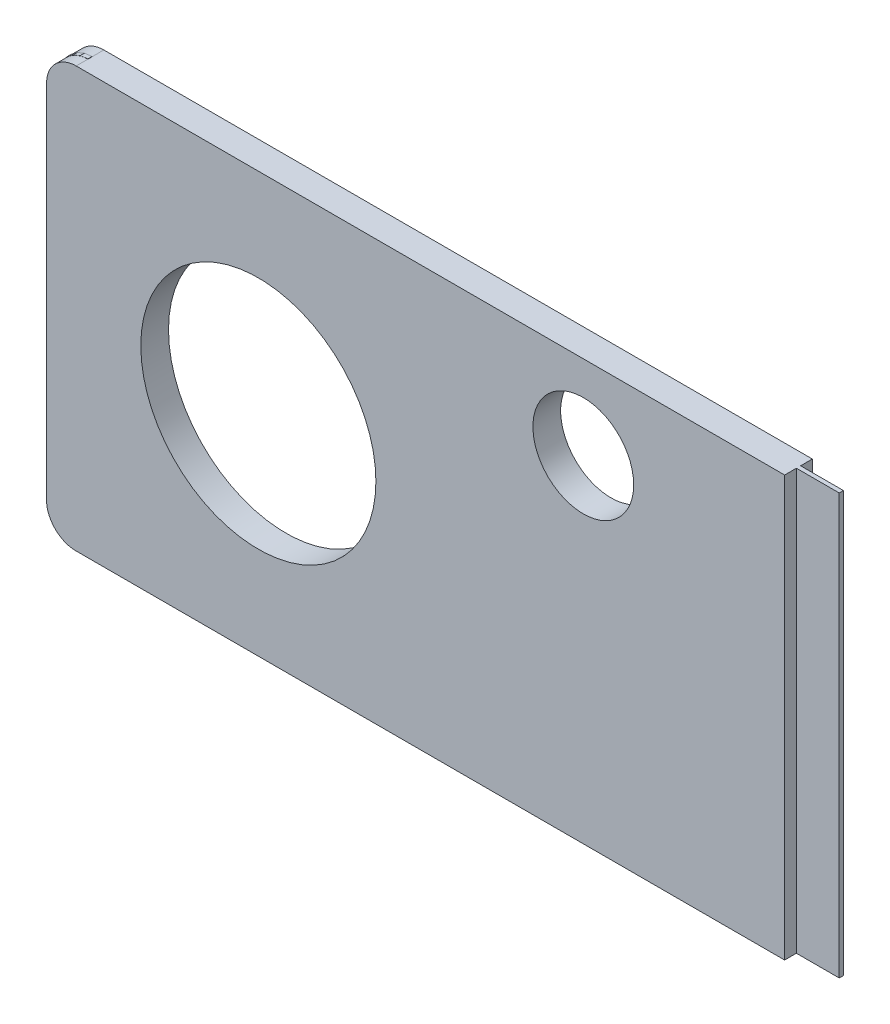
from build123d import *
from build123d.topology import SkipClean

# Parameters (mm, degrees)
SKETCH1_R                = 0.3175
SKETCH1_R_2              = 0.508
SKETCH1_R_3              = 1.524
SKETCH1_R_4              = 3.556
BOSS_EXTRUDE1_DEPTH      = 0.127
BOSS_EXTRUDE2_START      = 0.0508
SKETCH2_R                = 0.6985
SKETCH2_R_2              = 0.3175
BOSS_EXTRUDE2_DEPTH      = 0.0508
BOSS_EXTRUDE4_START      = 0.0508
SKETCH4_R                = 1.27
SKETCH4_R_2              = 0.508
BOSS_EXTRUDE4_DEPTH      = 0.0508
SKETCH5_R                = 1.27
SKETCH5_R_2              = 0.508
BOSS_EXTRUDE5_DEPTH      = 0.0508
BOSS_EXTRUDE6_DEPTH      = 0.3556
BOSS_EXTRUDE6_DEPTH_BACK = 0.4826
SKETCH6_R                = 3.556
SKETCH6_R_2              = 1.524
SKETCH7_W                = 5.08
SKETCH7_H                = 5.08
BOSS_EXTRUDE7_DEPTH      = 0.0508
BOSS_EXTRUDE8_START      = 0.3556
SKETCH9_R                = 1.524
BOSS_EXTRUDE8_DEPTH      = 0.3556
BOSS_EXTRUDE9_START      = 0.3556
SKETCH10_R               = 1.524
BOSS_EXTRUDE9_DEPTH      = 0.3556
BOSS_EXTRUDE10_START     = 0.3556
SKETCH11_R               = 5.2197
SKETCH11_R_2             = 3.556
SKETCH11_R_3             = 1.524
BOSS_EXTRUDE10_DEPTH     = 0.3556
SKETCH12_W               = 21.2598
SKETCH12_H               = 12.707452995
SKETCH12_R               = 1.524
BOSS_EXTRUDE11_DEPTH     = 0.3556
SKETCH13_W               = 21.2852
SKETCH13_H               = 12.707452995
SKETCH13_R               = 1.524
BOSS_EXTRUDE12_DEPTH     = 0.3556
SKETCH14_R               = 1.778
SKETCH14_R_2             = 1.524
SKETCH14_R_3             = 3.556
SKETCH14_R_4             = 5.2197
BOSS_EXTRUDE13_DEPTH     = 0.3556
BOSS_EXTRUDE17_DEPTH     = 0.0508
SKETCH18_W               = 1.099038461
SKETCH18_H               = 0.529166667
BOSS_EXTRUDE19_DEPTH     = 0.0508
SKETCH19_OUTSIDE_W       = 148.554
SKETCH19_OUTSIDE_H       = 44.448
SKETCH19_OUTSIDE_W_2     = 23.622
SKETCH19_OUTSIDE_H_2     = 19.197836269
CUT_EXTRUDE1_DEPTH       = 2.54


with BuildPart() as part:
    # Sketch1 → Boss-Extrude1 (new body)
    with BuildSketch(Plane.XY.offset(0.39116)):
        Polygon((156.11155468, 251.50762754), (156.337, 251.47794764), (256.286000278, 251.47794764), (256.286000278, 251.48474214), (256.491552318, 251.45768098), (256.683098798, 251.378339), (256.847581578, 251.25212894), (256.973791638, 251.08764616), (257.053133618, 250.89609968), (257.080194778, 250.69054764), (257.073399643, 247.66794764), (257.062440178, 247.66794764), (257.106087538, 247.3364116), (257.234055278, 247.02746886), (257.437623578, 246.76217348), (257.702918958, 246.55860518), (258.011861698, 246.43063744), (258.343398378, 246.386990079), (268.503400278, 246.397947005), (268.503400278, 246.38698754), (268.834936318, 246.4306349), (269.143879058, 246.55860264), (269.409174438, 246.76217094), (269.612742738, 247.02746632), (269.740710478, 247.33640906), (269.784357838, 247.6679451), (269.773400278, 250.63974764), (269.766166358, 250.63974764), (269.794975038, 250.85856102), (269.879432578, 251.0624646), (270.013788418, 251.2375595), (270.188883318, 251.37191534), (270.392786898, 251.45637288), (270.611600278, 251.48518156), (271.018000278, 251.47794764), (271.018000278, 251.46794258), (271.730094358, 251.50793234), (272.433234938, 251.62740124), (273.118577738, 251.8248456), (273.777501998, 252.0977813), (274.401727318, 252.4427768), (274.983397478, 252.85549632), (275.515202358, 253.33074556), (275.990451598, 253.86255044), (276.403171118, 254.4442206), (276.748166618, 255.06844592), (277.021102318, 255.72737018), (277.218546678, 256.41271298), (277.338015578, 257.11585356), (277.378005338, 257.82794764), (277.337522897, 258.536938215), (277.21811535, 259.240089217), (277.020730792, 259.925449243), (276.747852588, 260.584397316), (276.402911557, 261.208652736), (275.990242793, 261.790358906), (275.515039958, 262.322205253), (274.983276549, 262.797500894), (274.401642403, 263.210271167), (273.777447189, 263.555321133), (273.118546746, 263.828314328), (272.433221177, 264.025818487), (271.730091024, 264.14534874), (271.018000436, 264.185400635), (156.3624, 264.185400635), (156.3624, 264.19307334), (156.13032528, 264.16251968), (155.9140646, 264.0729415), (155.72835758, 263.93044496), (155.58586104, 263.74473794), (155.49628286, 263.52847726), (155.4657292, 263.296401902), (155.4734, 252.349), (155.46594764, 252.349), (155.49562754, 252.12355468), (155.5826454, 251.91347382), (155.72107286, 251.73307286), (155.90147382, 251.5946454), align=None)
        with Locations(Location((269.24, 259.7658, 0), (0, 0, 180))):
            Circle(SKETCH1_R, mode=Mode.SUBTRACT)
        with Locations(Location((270.9164, 258.8006, 0), (0, 0, 180))):
            Circle(SKETCH1_R, mode=Mode.SUBTRACT)
        with Locations(Location((267.5636, 258.8006, 0), (0, 0, 180))):
            Circle(SKETCH1_R, mode=Mode.SUBTRACT)
        with Locations(Location((269.24, 257.8354, 0), (0, 0, 180))):
            Circle(SKETCH1_R, mode=Mode.SUBTRACT)
        with Locations(Location((270.9164, 256.8702, 0), (0, 0, 180))):
            Circle(SKETCH1_R, mode=Mode.SUBTRACT)
        with Locations(Location((269.24, 255.905, 0), (0, 0, 180))):
            Circle(SKETCH1_R, mode=Mode.SUBTRACT)
        with Locations(Location((267.5636, 256.8702, 0), (0, 0, 180))):
            Circle(SKETCH1_R, mode=Mode.SUBTRACT)
        with Locations(Location((265.9634, 248.9454, 0), (0, 0, 180))):
            Circle(SKETCH1_R_2, mode=Mode.SUBTRACT)
        with Locations(Location((215.6714, 261.6454, 0), (0, 0, 180))):
            Circle(SKETCH1_R_3, mode=Mode.SUBTRACT)
        with Locations(Location((235.077, 261.6454, 0), (0, 0, 180))):
            Circle(SKETCH1_R_3, mode=Mode.SUBTRACT)
        with Locations(Location((171.704, 261.6454, 0), (0, 0, 180))):
            Circle(SKETCH1_R_3, mode=Mode.SUBTRACT)
        with Locations(Location((191.0842, 261.6454, 0), (0, 0, 180))):
            Circle(SKETCH1_R_3, mode=Mode.SUBTRACT)
        with Locations(Location((244.9068, 257.8354, 0), (0, 0, 180))):
            Circle(SKETCH1_R_4, mode=Mode.SUBTRACT)
        with Locations(Location((260.8834, 248.9454, 0), (0, 0, 180))):
            Circle(SKETCH1_R_2, mode=Mode.SUBTRACT)
        with Locations(Location((161.8742, 257.8354, 0), (0, 0, 180))):
            Circle(SKETCH1_R_4, mode=Mode.SUBTRACT)
    extrude(amount=-BOSS_EXTRUDE1_DEPTH)

    # Sketch2 → Boss-Extrude2 (add)
    # profile 1 of 7: a face of its own
    with BuildSketch(Plane.XY.offset(0.39116).offset(BOSS_EXTRUDE2_START)):
        with Locations((269.24, 259.7658)):
            Circle(SKETCH2_R)
        with Locations((269.24, 259.7658)):
            Circle(SKETCH2_R_2, mode=Mode.SUBTRACT)
    # profile 2 of 7: a face of its own
    with BuildSketch(Plane.XY.offset(0.39116).offset(BOSS_EXTRUDE2_START)):
        with Locations((270.9164, 258.8006)):
            Circle(SKETCH2_R)
        with Locations((270.9164, 258.8006)):
            Circle(SKETCH2_R_2, mode=Mode.SUBTRACT)
    # profile 3 of 7: a face of its own
    with BuildSketch(Plane.XY.offset(0.39116).offset(BOSS_EXTRUDE2_START)):
        with Locations((270.9164, 256.8702)):
            Circle(SKETCH2_R)
        with Locations((270.9164, 256.8702)):
            Circle(SKETCH2_R_2, mode=Mode.SUBTRACT)
    # profile 4 of 7: a face of its own
    with BuildSketch(Plane.XY.offset(0.39116).offset(BOSS_EXTRUDE2_START)):
        with Locations((269.24, 255.905)):
            Circle(SKETCH2_R)
        with Locations((269.24, 255.905)):
            Circle(SKETCH2_R_2, mode=Mode.SUBTRACT)
    # profile 5 of 7: a face of its own
    with BuildSketch(Plane.XY.offset(0.39116).offset(BOSS_EXTRUDE2_START)):
        with Locations((269.24, 257.8354)):
            Circle(SKETCH2_R)
        with Locations((269.24, 257.8354)):
            Circle(SKETCH2_R_2, mode=Mode.SUBTRACT)
    # profile 6 of 7: a face of its own
    with BuildSketch(Plane.XY.offset(0.39116).offset(BOSS_EXTRUDE2_START)):
        with Locations((267.5636, 256.8702)):
            Circle(SKETCH2_R)
        with Locations((267.5636, 256.8702)):
            Circle(SKETCH2_R_2, mode=Mode.SUBTRACT)
    # profile 7 of 7: a face of its own
    with BuildSketch(Plane.XY.offset(0.39116).offset(BOSS_EXTRUDE2_START)):
        with Locations((267.5636, 258.8006)):
            Circle(SKETCH2_R)
        with Locations((267.5636, 258.8006)):
            Circle(SKETCH2_R_2, mode=Mode.SUBTRACT)
    extrude(amount=-BOSS_EXTRUDE2_DEPTH)

    # Sketch4 → Boss-Extrude4 (add)
    # profile 1 of 2: a face of its own
    with BuildSketch(Plane.XY.offset(0.39116).offset(BOSS_EXTRUDE4_START)):
        with Locations((260.8834, 248.9454)):
            Circle(SKETCH4_R)
        with Locations((260.8834, 248.9454)):
            Circle(SKETCH4_R_2, mode=Mode.SUBTRACT)
    # profile 2 of 2: a face of its own
    with BuildSketch(Plane.XY.offset(0.39116).offset(BOSS_EXTRUDE4_START)):
        with Locations((265.9634, 248.9454)):
            Circle(SKETCH4_R)
        with Locations((265.9634, 248.9454)):
            Circle(SKETCH4_R_2, mode=Mode.SUBTRACT)
    extrude(amount=-BOSS_EXTRUDE4_DEPTH)

    # Sketch5 → Boss-Extrude5 (add)
    # profile 1 of 2: a face of its own
    with BuildSketch(Plane.XY.offset(0.26416)):
        with Locations((265.9634, 248.9454)):
            Circle(SKETCH5_R)
        with Locations((265.9634, 248.9454)):
            Circle(SKETCH5_R_2, mode=Mode.SUBTRACT)
    # profile 2 of 2: a face of its own
    with BuildSketch(Plane.XY.offset(0.26416)):
        with Locations((260.8834, 248.9454)):
            Circle(SKETCH5_R)
        with Locations((260.8834, 248.9454)):
            Circle(SKETCH5_R_2, mode=Mode.SUBTRACT)
    extrude(amount=-BOSS_EXTRUDE5_DEPTH)

    # Sketch6 → Boss-Extrude6 (add, two sides: drawn at the far end of the back side and taken through both)
    with SkipClean():  # the faces are left unmerged after this step: merging them gives an invalid solid
        with BuildSketch(Plane.XY.offset(0.39116).offset(-BOSS_EXTRUDE6_DEPTH_BACK)):
            with BuildLine():
                Line((177.79487504, 251.47794764), (177.79487504, 264.185402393))
                Line((177.79487504, 264.185402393), (156.3624, 264.185400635))
                ThreePointArc((156.3624, 264.185400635), (155.739568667, 263.929838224), (155.46827504, 263.313696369))
                Line((155.46827504, 263.313696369), (155.46827504, 252.300953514))
                ThreePointArc((155.46827504, 252.300953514), (155.743741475, 251.721727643), (156.337, 251.47794764))
                Line((156.337, 251.47794764), (177.79487504, 251.47794764))
            make_face()
            with Locations((161.8742, 257.8354)):
                Circle(SKETCH6_R, mode=Mode.SUBTRACT)
            with Locations((171.704, 261.6454)):
                Circle(SKETCH6_R_2, mode=Mode.SUBTRACT)
        extrude(amount=BOSS_EXTRUDE6_DEPTH + BOSS_EXTRUDE6_DEPTH_BACK)

    # Sketch7 → Boss-Extrude7 (add)
    with SkipClean():  # the faces are left unmerged after this step: merging them gives an invalid solid
        with BuildSketch(Plane.XY.offset(0.39116)):
            with Locations((185.3692, 254.65294764)):
                Rectangle(SKETCH7_W, SKETCH7_H)
            with BuildLine():
                Line((194.2592, 256.93894764), (194.2592, 252.36694764))
                ThreePointArc((194.2592, 252.36694764), (194.333594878, 252.187342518), (194.5132, 252.11294764))
                Line((194.5132, 252.11294764), (199.0852, 252.11294764))
                ThreePointArc((199.0852, 252.11294764), (199.264805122, 252.187342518), (199.3392, 252.36694764))
                Line((199.3392, 252.36694764), (199.3392, 256.93894764))
                ThreePointArc((199.3392, 256.93894764), (199.264805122, 257.118552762), (199.0852, 257.19294764))
                Line((199.0852, 257.19294764), (194.5132, 257.19294764))
                ThreePointArc((194.5132, 257.19294764), (194.333594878, 257.118552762), (194.2592, 256.93894764))
            make_face()
            with Locations((209.9564, 254.65294764)):
                Rectangle(SKETCH7_W, SKETCH7_H)
            with BuildLine():
                Line((219.1004, 257.19294764), (223.6724, 257.19294764))
                ThreePointArc((223.6724, 257.19294764), (223.852005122, 257.118552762), (223.9264, 256.93894764))
                Line((223.9264, 256.93894764), (223.9264, 252.36694764))
                ThreePointArc((223.9264, 252.36694764), (223.852005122, 252.187342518), (223.6724, 252.11294764))
                Line((223.6724, 252.11294764), (219.1004, 252.11294764))
                ThreePointArc((219.1004, 252.11294764), (218.920794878, 252.187342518), (218.8464, 252.36694764))
                Line((218.8464, 252.36694764), (218.8464, 256.93894764))
                ThreePointArc((218.8464, 256.93894764), (218.920794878, 257.118552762), (219.1004, 257.19294764))
            make_face()
        extrude(amount=BOSS_EXTRUDE7_DEPTH)

    # Sketch9 → Boss-Extrude8 (add)
    with SkipClean():  # the faces are left unmerged after this step: merging them gives an invalid solid
        with BuildSketch(Plane.XY.offset(0.39116).offset(BOSS_EXTRUDE8_START)):
            with BuildLine():
                ThreePointArc((188.602516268, 257.353947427), (188.453726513, 257.713157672), (188.094516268, 257.861947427))
                Line((188.094516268, 257.861947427), (180.79207504, 257.861947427))
                Line((180.79207504, 257.861947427), (180.79207504, 264.18540068))
                Line((180.79207504, 264.18540068), (202.05187504, 264.185401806))
                Line((202.05187504, 264.185401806), (202.05187504, 257.861947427))
                Line((202.05187504, 257.861947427), (194.107504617, 257.861947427))
                ThreePointArc((194.107504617, 257.861947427), (193.748294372, 257.713157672), (193.599504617, 257.353947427))
                Line((193.599504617, 257.353947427), (193.599504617, 255.16094764))
                ThreePointArc((193.599504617, 255.16094764), (193.450714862, 254.801737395), (193.091504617, 254.65294764))
                Line((193.091504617, 254.65294764), (189.110516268, 254.65294764))
                ThreePointArc((189.110516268, 254.65294764), (188.751306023, 254.801737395), (188.602516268, 255.16094764))
                Line((188.602516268, 255.16094764), (188.602516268, 257.353947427))
            make_face()
            with Locations((191.0842, 261.6454)):
                Circle(SKETCH9_R, mode=Mode.SUBTRACT)
        extrude(amount=-BOSS_EXTRUDE8_DEPTH)

    # Sketch10 → Boss-Extrude9 (add)
    with SkipClean():  # the faces are left unmerged after this step: merging them gives an invalid solid
        with BuildSketch(Plane.XY.offset(0.39116).offset(BOSS_EXTRUDE9_START)):
            with BuildLine():
                ThreePointArc((213.098791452, 257.353947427), (212.950001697, 257.713157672), (212.590791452, 257.861947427))
                Line((212.590791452, 257.861947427), (204.99827504, 257.861947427))
                Line((204.99827504, 257.861947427), (204.99827504, 264.185400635))
                Line((204.99827504, 264.185400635), (226.28347504, 264.185400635))
                Line((226.28347504, 264.185400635), (226.28347504, 257.861947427))
                Line((226.28347504, 257.861947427), (218.650909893, 257.861947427))
                ThreePointArc((218.650909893, 257.861947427), (218.291699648, 257.713157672), (218.142909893, 257.353947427))
                Line((218.142909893, 257.353947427), (218.142909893, 255.16094764))
                ThreePointArc((218.142909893, 255.16094764), (217.994120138, 254.801737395), (217.634909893, 254.65294764))
                Line((217.634909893, 254.65294764), (213.606791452, 254.65294764))
                ThreePointArc((213.606791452, 254.65294764), (213.247581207, 254.801737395), (213.098791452, 255.16094764))
                Line((213.098791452, 255.16094764), (213.098791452, 257.353947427))
            make_face()
            with Locations((215.6714, 261.6454)):
                Circle(SKETCH10_R, mode=Mode.SUBTRACT)
        extrude(amount=-BOSS_EXTRUDE9_DEPTH)

    # Sketch11 → Boss-Extrude10 (add)
    with SkipClean():  # the faces are left unmerged after this step: merging them gives an invalid solid
        with BuildSketch(Plane.XY.offset(0.39116).offset(BOSS_EXTRUDE10_START)):
            with BuildLine():
                ThreePointArc((271.730091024, 264.14534874), (277.367721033, 257.826642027), (271.730094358, 251.50793234))
                Line((271.730094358, 251.50793234), (229.22987504, 251.478351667))
                Line((229.22987504, 251.478351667), (229.22987504, 264.184362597))
                Line((229.22987504, 264.184362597), (271.730091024, 264.14534874))
            make_face()
            with Locations((269.24, 257.8354)):
                Circle(SKETCH11_R, mode=Mode.SUBTRACT)
            with Locations((244.9068, 257.8354)):
                Circle(SKETCH11_R_2, mode=Mode.SUBTRACT)
            with Locations((235.077, 261.6454)):
                Circle(SKETCH11_R_3, mode=Mode.SUBTRACT)
        extrude(amount=-BOSS_EXTRUDE10_DEPTH)

    # Sketch12 → Boss-Extrude11 (add)
    with SkipClean():  # the faces are left unmerged after this step: merging them gives an invalid solid
        with BuildSketch(Plane(origin=(0, 0, 0.26416), x_dir=(-1, 0, 0), z_dir=(0, 0, -1))):
            with Locations((-191.42197504, 257.831674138)):
                Rectangle(SKETCH12_W, SKETCH12_H)
            with Locations((-191.0842, 261.6454)):
                Circle(SKETCH12_R, mode=Mode.SUBTRACT)
        extrude(amount=BOSS_EXTRUDE11_DEPTH)

    # Sketch13 → Boss-Extrude12 (add)
    with SkipClean():  # the faces are left unmerged after this step: merging them gives an invalid solid
        with BuildSketch(Plane(origin=(0, 0, 0.26416), x_dir=(-1, 0, 0), z_dir=(0, 0, -1))):
            with Locations((-215.64087504, 257.831674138)):
                Rectangle(SKETCH13_W, SKETCH13_H)
            with Locations((-215.6714, 261.6454)):
                Circle(SKETCH13_R, mode=Mode.SUBTRACT)
        extrude(amount=BOSS_EXTRUDE12_DEPTH)

    # Sketch14 → Boss-Extrude13 (add)
    with SkipClean():  # the faces are left unmerged after this step: merging them gives an invalid solid
        with BuildSketch(Plane(origin=(0, 0, 0.26416), x_dir=(-1, 0, 0), z_dir=(0, 0, -1))):
            with BuildLine():
                Line((-271.015154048, 251.477947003), (-270.605817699, 251.477947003))
                ThreePointArc((-270.605817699, 251.477947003), (-270.016863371, 251.23040133), (-269.773400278, 250.63974764))
                Line((-269.773400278, 250.63974764), (-269.784357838, 247.6679451))
                ThreePointArc((-269.784357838, 247.6679451), (-269.410770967, 246.763750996), (-268.503400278, 246.397947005))
                Line((-268.503400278, 246.397947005), (-258.343398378, 246.386990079))
                ThreePointArc((-258.343398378, 246.386990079), (-257.445612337, 246.770161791), (-257.062440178, 247.66794764))
                Line((-257.062440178, 247.66794764), (-257.080194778, 250.69054764))
                ThreePointArc((-257.080194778, 250.69054764), (-256.844162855, 251.246702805), (-256.286000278, 251.47794764))
                Line((-256.286000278, 251.47794764), (-229.22987504, 251.47794764))
                Line((-229.22987504, 251.47794764), (-229.22987504, 264.184362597))
                Line((-229.22987504, 264.184362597), (-271.730091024, 264.14534874))
                ThreePointArc((-271.730091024, 264.14534874), (-277.358934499, 257.473785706), (-271.015154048, 251.477947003))
            make_face()
            with Locations((-260.8834, 248.9454)):
                Circle(SKETCH14_R, mode=Mode.SUBTRACT)
            with Locations((-265.9634, 248.9454)):
                Circle(SKETCH14_R, mode=Mode.SUBTRACT)
            with Locations((-235.077, 261.6454)):
                Circle(SKETCH14_R_2, mode=Mode.SUBTRACT)
            with Locations((-244.9068, 257.8354)):
                Circle(SKETCH14_R_3, mode=Mode.SUBTRACT)
            with Locations((-269.24, 257.8354)):
                Circle(SKETCH14_R_4, mode=Mode.SUBTRACT)
        extrude(amount=BOSS_EXTRUDE13_DEPTH)

    # Sketch17 → Boss-Extrude17 (add)
    with SkipClean():  # the faces are left unmerged after this step: merging them gives an invalid solid
        with BuildSketch(Plane(origin=(0, 0, 0.26416), x_dir=(-1, 0, 0), z_dir=(0, 0, -1))):
            with BuildLine():
                Line((-267.284159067, 258.170767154), (-265.332275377, 258.166685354))
                Line((-265.332275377, 258.166685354), (-261.5184, 254.422244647))
                Line((-261.5184, 254.422244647), (-261.5184, 250.045888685))
                ThreePointArc((-261.5184, 250.045888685), (-260.883385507, 250.074491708), (-260.2484, 250.045252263))
                Line((-260.2484, 250.045252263), (-260.2484, 254.955143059))
                Line((-260.2484, 254.955143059), (-264.811939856, 259.4356))
                Line((-264.811939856, 259.4356), (-267.284163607, 259.44076994))
                ThreePointArc((-267.284163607, 259.44076994), (-266.982140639, 258.805769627), (-267.284159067, 258.170767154))
            make_face()
            with BuildLine():
                Line((-267.284150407, 256.230035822), (-266.701334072, 256.230676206))
                Line((-266.701334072, 256.230676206), (-266.5984, 256.146143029))
                Line((-266.5984, 256.146143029), (-266.5984, 250.045243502))
                ThreePointArc((-266.5984, 250.045243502), (-265.963400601, 250.13231716), (-265.3284, 250.045252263))
                Line((-265.3284, 250.045252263), (-265.3284, 256.746549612))
                Line((-265.3284, 256.746549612), (-266.247290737, 257.501175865))
                Line((-266.247290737, 257.501175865), (-267.284165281, 257.500036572))
                ThreePointArc((-267.284165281, 257.500036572), (-266.919694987, 256.865040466), (-267.284150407, 256.230035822))
            make_face()
        extrude(amount=BOSS_EXTRUDE17_DEPTH)

    # Sketch18 → Boss-Extrude19 (add)
    with SkipClean():  # the faces are left unmerged after this step: merging them gives an invalid solid
        with BuildSketch(Plane.XY.offset(0.39116)):
            Polygon((258.287631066, 250.186779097), (258.287631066, 250.960176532), (258.816797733, 250.960176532), (258.816797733, 250.186779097), (259.630900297, 250.186779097), (259.630900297, 249.65761243), (258.816797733, 249.65761243), (258.816797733, 248.884214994), (258.287631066, 248.884214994), (258.287631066, 249.65761243), (257.473528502, 249.65761243), (257.473528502, 250.186779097), align=None)
            with Locations((268.117919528, 249.55584961)):
                Rectangle(SKETCH18_W, SKETCH18_H)
        extrude(amount=BOSS_EXTRUDE19_DEPTH)

    # Sketch19 outside → Cut-Extrude1 (cut)
    with SkipClean():  # the faces are left unmerged after this step: merging them gives an invalid solid
        with BuildSketch(Plane.XY.offset(0.74676)):
            with Locations((216.422, 255.29)):
                Rectangle(SKETCH19_OUTSIDE_W, SKETCH19_OUTSIDE_H)
            with Locations((167.27927504, 258.190494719)):
                Rectangle(SKETCH19_OUTSIDE_W_2, SKETCH19_OUTSIDE_H_2, mode=Mode.SUBTRACT)
        extrude(amount=-CUT_EXTRUDE1_DEPTH, mode=Mode.SUBTRACT)


solid = part.part
